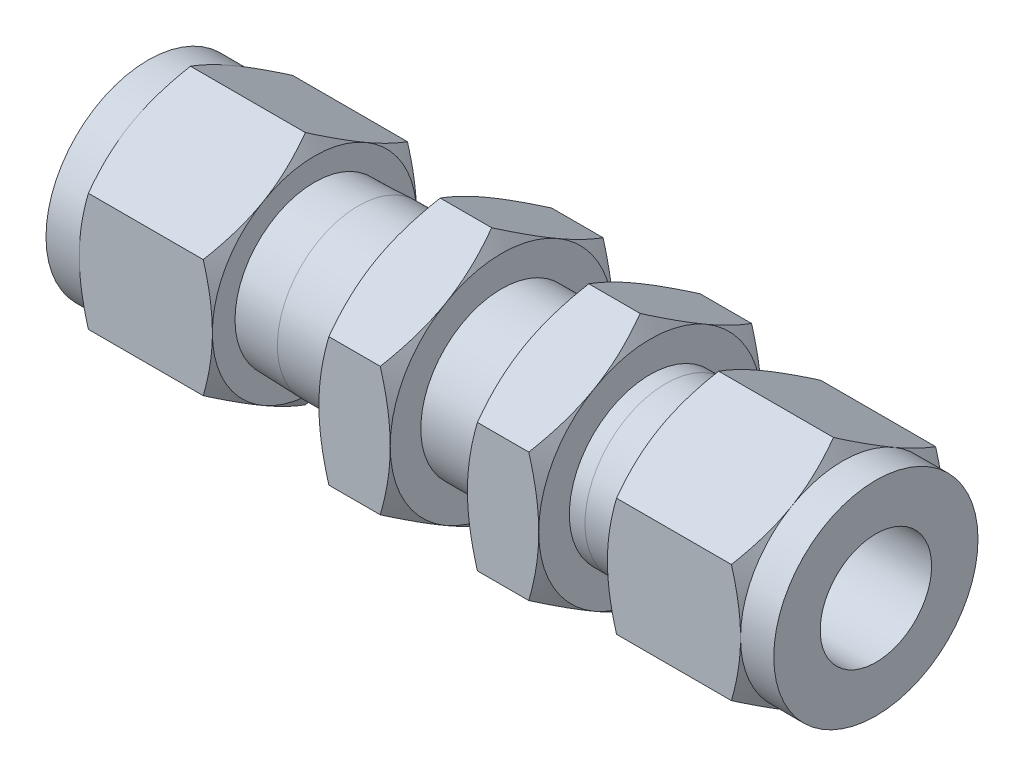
from build123d import *

# Parameters (mm, degrees)
EXTRUDE1_DEPTH      = 6.096
EXTRUDE2_DEPTH      = 1.34112
EXTRUDE2_DEPTH_BACK = 24.96312
SKETCH3_R           = 6.91007
SKETCH4_R           = 6.91007
EXTRUDE3_DEPTH      = 3.73888
EXTRUDE3_TAPER      = 1.78
EXTRUDE4_DEPTH      = 11.3792
SKETCH6_R           = 8.73125
EXTRUDE5_DEPTH      = 2.8448
SKETCH10_R          = 4.7625
EXTRUDE7_DEPTH      = 16.764
LPATTERN1_COUNT     = 2
LPATTERN1_PITCH     = 12.7
SKETCH9_R           = 3.556
EXTRUDE6_DEPTH      = 64.908262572


with BuildPart() as part:
    # Sketch2 → Extrude1 (new body)
    with BuildSketch(Plane(origin=(0, 0, 0), x_dir=(0, 0, -1), z_dir=(1, 0, 0))):
        Polygon((0, -10.998522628), (9.525, -5.499261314), (9.525, 5.499261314), (0, 10.998522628), (-9.525, 5.499261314), (-9.525, -5.499261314), align=None)
    extrude1 = extrude(amount=EXTRUDE1_DEPTH)

    # Sketch7 → Cut-Revolve1 (revolve, cut)
    with BuildSketch(Plane.XY):
        Polygon((0, 9.525), (0.850738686, 10.998522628), (0, 10.998522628), align=None)
        Polygon((6.096, 10.998522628), (6.096, 9.525), (5.245261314, 10.998522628), align=None)
    cut_revolve1 = revolve(axis=Axis((0, 0, 0), (1, 0, 0)), mode=Mode.SUBTRACT)

    # Sketch3 → Extrude2 (add, two sides: drawn at the far end of the back side and taken through both)
    with BuildSketch(Plane(origin=(6.096, 0, 0), x_dir=(0, 0, -1), z_dir=(1, 0, 0)).offset(-EXTRUDE2_DEPTH_BACK)):
        Circle(SKETCH3_R)
    extrude(amount=EXTRUDE2_DEPTH + EXTRUDE2_DEPTH_BACK)

    # Sketch4 → Extrude3 (add)
    with BuildSketch(Plane(origin=(7.43712, 0, 0), x_dir=(0, 0, -1), z_dir=(1, 0, 0))):
        Circle(SKETCH4_R)
    extrude3 = extrude(amount=EXTRUDE3_DEPTH, taper=EXTRUDE3_TAPER)

    # Sketch5 → Extrude4 (add)
    with BuildSketch(Plane(origin=(11.176, 0, 0), x_dir=(0, 0, -1), z_dir=(1, 0, 0))):
        Polygon((0, 10.081979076), (-8.73125, 5.040989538), (-8.73125, -5.040989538), (0, -10.081979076), (8.73125, -5.040989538), (8.73125, 5.040989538), align=None)
    extrude4 = extrude(amount=EXTRUDE4_DEPTH)

    # Sketch8 → Cut-Revolve2 (revolve, cut)
    with BuildSketch(Plane.XY):
        Polygon((11.176, 8.73125), (11.176, 10.081979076), (11.955843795, 10.081979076), align=None)
        Polygon((21.775356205, 10.081979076), (22.5552, 8.73125), (22.5552, 10.081979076), align=None)
    cut_revolve2 = revolve(axis=Axis((0, 0, 0), (1, 0, 0)), mode=Mode.SUBTRACT)

    # Sketch6 → Extrude5 (add)
    with BuildSketch(Plane(origin=(22.5552, 0, 0), x_dir=(0, 0, -1), z_dir=(1, 0, 0))):
        Circle(SKETCH6_R)
    extrude5 = extrude(amount=EXTRUDE5_DEPTH)

    # Sketch10 → Extrude7 (cut)
    with BuildSketch(Plane(origin=(25.4, 0, 0), x_dir=(0, 0, -1), z_dir=(1, 0, 0))):
        Circle(SKETCH10_R)
    extrude7 = extrude(amount=-EXTRUDE7_DEPTH, mode=Mode.SUBTRACT)

    # Mirror1: Extrude3, Extrude4, Cut-Revolve2, Extrude5, Extrude7 across plane
    add(extrude3.mirror(Plane(origin=(-5.715, 0, 0), x_dir=(0, 0, 1), z_dir=(1, 0, 0))))
    add(extrude4.mirror(Plane(origin=(-5.715, 0, 0), x_dir=(0, 0, 1), z_dir=(1, 0, 0))))
    add(cut_revolve2.mirror(Plane(origin=(-5.715, 0, 0), x_dir=(0, 0, 1), z_dir=(1, 0, 0))), mode=Mode.SUBTRACT)
    add(extrude5.mirror(Plane(origin=(-5.715, 0, 0), x_dir=(0, 0, 1), z_dir=(1, 0, 0))))
    add(extrude7.mirror(Plane(origin=(-5.715, 0, 0), x_dir=(0, 0, 1), z_dir=(1, 0, 0))), mode=Mode.SUBTRACT)

    # LPattern1: Extrude1, Cut-Revolve1 ×2
    with Locations(*[(-i * LPATTERN1_PITCH, 0, 0) for i in range(1, LPATTERN1_COUNT)]):
        add(extrude1)
        add(cut_revolve1, mode=Mode.SUBTRACT)

    # Sketch9 → Extrude6 (cut, through all)
    with BuildSketch(Plane(origin=(25.4, 0, 0), x_dir=(0, 0, -1), z_dir=(1, 0, 0))):
        Circle(SKETCH9_R)
    extrude(amount=-EXTRUDE6_DEPTH, mode=Mode.SUBTRACT)


solid = part.part
